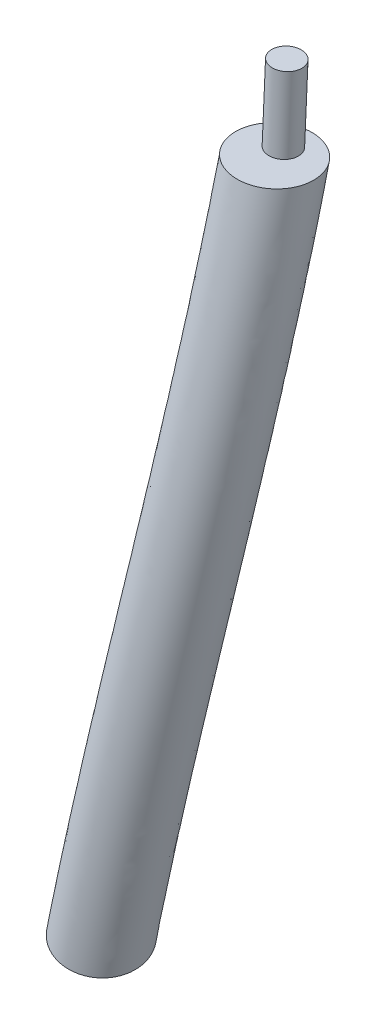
ISO-10303-21;
HEADER;
FILE_DESCRIPTION(('STEP AP214'),'2;1');
FILE_NAME('part.step','',(''),(''),'','','');
FILE_SCHEMA(('AUTOMOTIVE_DESIGN { 1 0 10303 214 1 1 1 1 }'));
ENDSEC;
DATA;
#1=APPLICATION_CONTEXT('core data for automotive mechanical design processes');
#2=APPLICATION_PROTOCOL_DEFINITION('international standard','automotive_design',2000,#1);
#3=PRODUCT_CONTEXT('',#1,'mechanical');
#4=PRODUCT('Part','Part','',(#3));
#5=PRODUCT_RELATED_PRODUCT_CATEGORY('part','',(#4));
#6=PRODUCT_DEFINITION_FORMATION('','',#4);
#7=PRODUCT_DEFINITION_CONTEXT('part definition',#1,'design');
#8=PRODUCT_DEFINITION('design','',#6,#7);
#9=PRODUCT_DEFINITION_SHAPE('','',#8);
#10=(LENGTH_UNIT() NAMED_UNIT(*) SI_UNIT(.MILLI.,.METRE.));
#11=(NAMED_UNIT(*) PLANE_ANGLE_UNIT() SI_UNIT($,.RADIAN.));
#12=(NAMED_UNIT(*) SI_UNIT($,.STERADIAN.) SOLID_ANGLE_UNIT());
#13=UNCERTAINTY_MEASURE_WITH_UNIT(LENGTH_MEASURE(1.E-05),#10,'distance_accuracy_value','');
#14=(GEOMETRIC_REPRESENTATION_CONTEXT(3) GLOBAL_UNCERTAINTY_ASSIGNED_CONTEXT((#13)) GLOBAL_UNIT_ASSIGNED_CONTEXT((#10,
#11,#12)) REPRESENTATION_CONTEXT('',''));
#15=CARTESIAN_POINT('',(0.,0.,0.));
#16=DIRECTION('',(0.,0.,1.));
#17=DIRECTION('',(1.,0.,0.));
#18=AXIS2_PLACEMENT_3D('',#15,#16,#17);
#19=CARTESIAN_POINT('',(-46.8725463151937,-4.55928526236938,-31.8));
#20=DIRECTION('',(-0.0440198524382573,-0.999030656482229,0.));
#21=DIRECTION('',(0.999030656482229,-0.0440198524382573,0.));
#22=AXIS2_PLACEMENT_3D('',#19,#20,#21);
#23=PLANE('',#22);
#24=CARTESIAN_POINT('',(-45.9172421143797,-4.60137841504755,-31.8));
#25=DIRECTION('',(0.0440198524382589,0.999030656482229,0.));
#26=DIRECTION('',(-0.999030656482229,0.0440198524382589,0.));
#27=AXIS2_PLACEMENT_3D('',#24,#25,#26);
#28=CIRCLE('',#27,0.193254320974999);
#29=CARTESIAN_POINT('',(-46.1103091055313,-4.59287138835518,-31.8));
#30=VERTEX_POINT('',#29);
#31=EDGE_CURVE('E18',#30,#30,#28,.F.);
#32=ORIENTED_EDGE('',*,*,#31,.F.);
#33=EDGE_LOOP('',(#32));
#34=FACE_BOUND('',#33,.T.);
#35=ADVANCED_FACE('F15',(#34),#23,.F.);
#36=CARTESIAN_POINT('',(-45.9392520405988,-5.10089374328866,-31.8));
#37=DIRECTION('',(0.0440198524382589,0.999030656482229,0.));
#38=DIRECTION('',(-0.999030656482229,0.0440198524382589,0.));
#39=AXIS2_PLACEMENT_3D('',#36,#37,#38);
#40=CYLINDRICAL_SURFACE('',#39,0.193254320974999);
#41=ORIENTED_EDGE('',*,*,#31,.T.);
#42=EDGE_LOOP('',(#41));
#43=FACE_BOUND('',#42,.T.);
#44=CARTESIAN_POINT('',(-45.9612619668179,-5.60040907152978,-31.8));
#45=DIRECTION('',(0.0440198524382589,0.999030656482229,0.));
#46=DIRECTION('',(-0.999030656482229,0.0440198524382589,0.));
#47=AXIS2_PLACEMENT_3D('',#44,#45,#46);
#48=CIRCLE('',#47,0.193254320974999);
#49=CARTESIAN_POINT('',(-46.1543289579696,-5.59190204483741,-31.8));
#50=VERTEX_POINT('',#49);
#51=EDGE_CURVE('E27',#50,#50,#48,.F.);
#52=ORIENTED_EDGE('',*,*,#51,.F.);
#53=EDGE_LOOP('',(#52));
#54=FACE_BOUND('',#53,.T.);
#55=ADVANCED_FACE('F52',(#43,#54),#40,.T.);
#56=CARTESIAN_POINT('',(-46.916566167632,-5.55831591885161,-31.8));
#57=DIRECTION('',(0.0440198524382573,0.999030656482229,0.));
#58=DIRECTION('',(-0.999030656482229,0.0440198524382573,0.));
#59=AXIS2_PLACEMENT_3D('',#56,#57,#58);
#60=PLANE('',#59);
#61=ORIENTED_EDGE('',*,*,#51,.T.);
#62=EDGE_LOOP('',(#61));
#63=FACE_BOUND('',#62,.T.);
#64=CARTESIAN_POINT('',(-45.4176626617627,-5.62436145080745,-31.6436344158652));
#65=CARTESIAN_POINT('',(-45.41756531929,-5.6243657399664,-31.671612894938));
#66=CARTESIAN_POINT('',(-45.4198199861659,-5.62426639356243,-31.6996243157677));
#67=CARTESIAN_POINT('',(-45.4289979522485,-5.62386198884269,-31.7549182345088));
#68=CARTESIAN_POINT('',(-45.4359310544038,-5.62355649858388,-31.7821990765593));
#69=CARTESIAN_POINT('',(-45.4542737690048,-5.62274827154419,-31.8351825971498));
#70=CARTESIAN_POINT('',(-45.4656790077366,-5.62224572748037,-31.8608867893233));
#71=CARTESIAN_POINT('',(-45.4926475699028,-5.62105742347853,-31.9100091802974));
#72=CARTESIAN_POINT('',(-45.5082111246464,-5.62037165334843,-31.9334272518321));
#73=CARTESIAN_POINT('',(-45.5430204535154,-5.61883786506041,-31.9772657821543));
#74=CARTESIAN_POINT('',(-45.5622591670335,-5.61799015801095,-31.9976918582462));
#75=CARTESIAN_POINT('',(-45.603892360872,-5.61615569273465,-32.0350207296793));
#76=CARTESIAN_POINT('',(-45.6262870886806,-5.61516892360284,-32.0519232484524));
#77=CARTESIAN_POINT('',(-45.6735670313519,-5.61308564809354,-32.0817096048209));
#78=CARTESIAN_POINT('',(-45.6984495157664,-5.6119892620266,-32.0945977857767));
#79=CARTESIAN_POINT('',(-45.7500521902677,-5.60971551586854,-32.1160352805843));
#80=CARTESIAN_POINT('',(-45.7767747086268,-5.60853805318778,-32.1245789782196));
#81=CARTESIAN_POINT('',(-45.8313060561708,-5.60613526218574,-32.137076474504));
#82=CARTESIAN_POINT('',(-45.8591162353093,-5.60490987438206,-32.1410243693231));
#83=CARTESIAN_POINT('',(-45.915004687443,-5.60244728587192,-32.144207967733));
#84=CARTESIAN_POINT('',(-45.9430829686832,-5.60121008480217,-32.1434435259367));
#85=CARTESIAN_POINT('',(-45.9988317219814,-5.59875365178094,-32.1372196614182));
#86=CARTESIAN_POINT('',(-46.0265000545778,-5.59753451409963,-32.1317410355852));
#87=CARTESIAN_POINT('',(-46.0804957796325,-5.59515532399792,-32.1162356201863));
#88=CARTESIAN_POINT('',(-46.1068248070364,-5.59399519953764,-32.1062145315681));
#89=CARTESIAN_POINT('',(-46.157547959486,-5.59176020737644,-32.0818619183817));
#90=CARTESIAN_POINT('',(-46.1819335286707,-5.5906857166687,-32.0675125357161));
#91=CARTESIAN_POINT('',(-46.2279564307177,-5.58865782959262,-32.0349285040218));
#92=CARTESIAN_POINT('',(-46.2495939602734,-5.58770442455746,-32.016694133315));
#93=CARTESIAN_POINT('',(-46.2895534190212,-5.58594370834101,-31.9768136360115));
#94=CARTESIAN_POINT('',(-46.3078683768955,-5.58513670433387,-31.9551605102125));
#95=CARTESIAN_POINT('',(-46.340603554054,-5.58369430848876,-31.9090834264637));
#96=CARTESIAN_POINT('',(-46.3550240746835,-5.58305890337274,-31.8846596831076));
#97=CARTESIAN_POINT('',(-46.3795658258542,-5.58197753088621,-31.8337188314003));
#98=CARTESIAN_POINT('',(-46.3896841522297,-5.58153169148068,-31.8072003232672));
#99=CARTESIAN_POINT('',(-46.4052932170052,-5.58084391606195,-31.7528804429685));
#100=CARTESIAN_POINT('',(-46.4107938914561,-5.58060154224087,-31.725081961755));
#101=CARTESIAN_POINT('',(-46.4158983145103,-5.58037662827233,-31.679266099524));
#102=CARTESIAN_POINT('',(-46.4169234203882,-5.58033145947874,-31.6613922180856));
#103=CARTESIAN_POINT('',(-46.4170867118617,-5.58032426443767,-31.6155303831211));
#104=CARTESIAN_POINT('',(-46.4148348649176,-5.58042348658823,-31.5875228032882));
#105=CARTESIAN_POINT('',(-46.4056631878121,-5.58082761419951,-31.5322360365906));
#106=CARTESIAN_POINT('',(-46.3987335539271,-5.58113295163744,-31.5049585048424));
#107=CARTESIAN_POINT('',(-46.3803981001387,-5.58194085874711,-31.4519809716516));
#108=CARTESIAN_POINT('',(-46.3689966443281,-5.58244323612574,-31.4262794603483));
#109=CARTESIAN_POINT('',(-46.3420358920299,-5.58363119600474,-31.3771618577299));
#110=CARTESIAN_POINT('',(-46.3264763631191,-5.58431678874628,-31.3537458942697));
#111=CARTESIAN_POINT('',(-46.2916759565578,-5.58585018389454,-31.3099115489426));
#112=CARTESIAN_POINT('',(-46.2724422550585,-5.58669767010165,-31.2894874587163));
#113=CARTESIAN_POINT('',(-46.2308196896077,-5.58853166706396,-31.2521612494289));
#114=CARTESIAN_POINT('',(-46.2084305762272,-5.58951818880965,-31.2352594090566));
#115=CARTESIAN_POINT('',(-46.1611596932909,-5.59160106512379,-31.2054709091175));
#116=CARTESIAN_POINT('',(-46.1362803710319,-5.59269731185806,-31.1925803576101));
#117=CARTESIAN_POINT('',(-46.0846838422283,-5.59497078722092,-31.1711368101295));
#118=CARTESIAN_POINT('',(-46.0579643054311,-5.59614811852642,-31.1625894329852));
#119=CARTESIAN_POINT('',(-46.0034338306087,-5.5985508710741,-31.1500819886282));
#120=CARTESIAN_POINT('',(-45.9756213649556,-5.59977635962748,-31.1461285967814));
#121=CARTESIAN_POINT('',(-45.919727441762,-5.60223918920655,-31.1429341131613));
#122=CARTESIAN_POINT('',(-45.8916459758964,-5.60347653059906,-31.1436931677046));
#123=CARTESIAN_POINT('',(-45.8358880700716,-5.60593336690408,-31.1499068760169));
#124=CARTESIAN_POINT('',(-45.8082138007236,-5.60715276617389,-31.1553810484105));
#125=CARTESIAN_POINT('',(-45.7542057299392,-5.6095325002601,-31.1708790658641));
#126=CARTESIAN_POINT('',(-45.7278702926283,-5.61069290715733,-31.1808972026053));
#127=CARTESIAN_POINT('',(-45.6771367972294,-5.6129283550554,-31.2052446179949));
#128=CARTESIAN_POINT('',(-45.6527470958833,-5.61400302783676,-31.2195913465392));
#129=CARTESIAN_POINT('',(-45.6067161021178,-5.61603127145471,-31.252171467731));
#130=CARTESIAN_POINT('',(-45.585074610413,-5.61698485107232,-31.2704045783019));
#131=CARTESIAN_POINT('',(-45.5451113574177,-5.61874573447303,-31.3102805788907));
#132=CARTESIAN_POINT('',(-45.5267959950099,-5.61955275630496,-31.331929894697));
#133=CARTESIAN_POINT('',(-45.4940597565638,-5.62099519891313,-31.3779997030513));
#134=CARTESIAN_POINT('',(-45.4796385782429,-5.62163063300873,-31.4024199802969));
#135=CARTESIAN_POINT('',(-45.4550962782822,-5.62271202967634,-31.4533520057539));
#136=CARTESIAN_POINT('',(-45.4449776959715,-5.62315788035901,-31.4798649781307));
#137=CARTESIAN_POINT('',(-45.4293667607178,-5.62384573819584,-31.5341738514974));
#138=CARTESIAN_POINT('',(-45.4238644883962,-5.62408818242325,-31.561966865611));
#139=CARTESIAN_POINT('',(-45.4187521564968,-5.62431344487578,-31.6078090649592));
#140=CARTESIAN_POINT('',(-45.4177250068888,-5.62435870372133,-31.6257149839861));
#141=CARTESIAN_POINT('',(-45.4176626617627,-5.62436145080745,-31.6436344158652));
#142=B_SPLINE_CURVE_WITH_KNOTS('',3,(#64,#65,#66,#67,#68,#69,#70,#71,#72,#73,#74,#75,#76,#77,
#78,#79,#80,#81,#82,#83,#84,#85,#86,#87,#88,#89,#90,#91,#92,#93,#94,#95,#96,#97,#98,#99,#100,
#101,#102,#103,#104,#105,#106,#107,#108,#109,#110,#111,#112,#113,#114,#115,#116,#117,#118,#119,
#120,#121,#122,#123,#124,#125,#126,#127,#128,#129,#130,#131,#132,#133,#134,#135,#136,#137,#138,
#139,#140,#141),.UNSPECIFIED.,.T.,.F.,(4,2,2,2,2,2,2,2,2,2,2,2,2,2,2,2,2,2,2,2,2,2,2,2,2,2,2,2,
2,2,2,2,2,2,2,2,2,2,4),(0.,0.0838797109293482,0.167935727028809,0.251909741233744,
0.335888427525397,0.419707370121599,0.503532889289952,0.587267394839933,0.671109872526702,
0.755059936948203,0.839012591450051,0.92330885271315,1.00749961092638,1.09204259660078,
1.17657952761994,1.26129183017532,1.3459975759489,1.43076041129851,1.51534038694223,
1.56896722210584,1.65283478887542,1.73687867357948,1.820840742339,1.90480750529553,
1.98861191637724,2.07242295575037,2.156152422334,2.23998993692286,2.32394912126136,
2.40791091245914,2.49222195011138,2.57642736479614,2.66097687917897,2.7455202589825,
2.83022460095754,2.91492236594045,2.99967004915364,3.08423515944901,3.13795776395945),.UNSPECIFIED.);
#143=CARTESIAN_POINT('',(-45.4176626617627,-5.62436145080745,-31.6436344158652));
#144=VERTEX_POINT('',#143);
#145=EDGE_CURVE('E22',#144,#144,#142,.T.);
#146=ORIENTED_EDGE('',*,*,#145,.T.);
#147=EDGE_LOOP('',(#146));
#148=FACE_BOUND('',#147,.T.);
#149=ADVANCED_FACE('F46',(#63,#148),#60,.T.);
#150=CARTESIAN_POINT('',(-48.2927702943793,-14.3510934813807,-30.812186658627));
#151=DIRECTION('',(-0.194254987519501,-0.968601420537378,-0.155165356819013));
#152=DIRECTION('',(0.980476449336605,-0.196636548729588,0.));
#153=AXIS2_PLACEMENT_3D('',#150,#151,#152);
#154=PLANE('',#153);
#155=CARTESIAN_POINT('',(-46.8104671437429,-14.6513251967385,-30.79375415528));
#156=CARTESIAN_POINT('',(-46.8116652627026,-14.655526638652,-30.766027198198));
#157=CARTESIAN_POINT('',(-46.815184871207,-14.6592619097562,-30.7383039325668));
#158=CARTESIAN_POINT('',(-46.8267871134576,-14.6656895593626,-30.683654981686));
#159=CARTESIAN_POINT('',(-46.8348795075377,-14.6683796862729,-30.6567311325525));
#160=CARTESIAN_POINT('',(-46.8553908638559,-14.6726298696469,-30.6045212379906));
#161=CARTESIAN_POINT('',(-46.8678050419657,-14.6741911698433,-30.5792334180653));
#162=CARTESIAN_POINT('',(-46.8966108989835,-14.6761434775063,-30.5309836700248));
#163=CARTESIAN_POINT('',(-46.9130028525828,-14.6765344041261,-30.5080219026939));
#164=CARTESIAN_POINT('',(-46.9492968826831,-14.6761348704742,-30.4650786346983));
#165=CARTESIAN_POINT('',(-46.9691986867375,-14.6753445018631,-30.4450969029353));
#166=CARTESIAN_POINT('',(-47.0119503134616,-14.6726047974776,-30.4086774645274));
#167=CARTESIAN_POINT('',(-47.0348003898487,-14.670655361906,-30.3922400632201));
#168=CARTESIAN_POINT('',(-47.0827819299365,-14.665654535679,-30.3633879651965));
#169=CARTESIAN_POINT('',(-47.1079118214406,-14.6626039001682,-30.3509705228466));
#170=CARTESIAN_POINT('',(-47.1597873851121,-14.6554823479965,-30.3304817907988));
#171=CARTESIAN_POINT('',(-47.1865350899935,-14.6514101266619,-30.3224161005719));
#172=CARTESIAN_POINT('',(-47.2408391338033,-14.6423660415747,-30.3108882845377));
#173=CARTESIAN_POINT('',(-47.2683949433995,-14.637394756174,-30.3074232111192));
#174=CARTESIAN_POINT('',(-47.3235494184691,-14.6266919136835,-30.3051853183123));
#175=CARTESIAN_POINT('',(-47.3511480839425,-14.6209603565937,-30.3064124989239));
#176=CARTESIAN_POINT('',(-47.4056223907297,-14.6088957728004,-30.3135266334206));
#177=CARTESIAN_POINT('',(-47.4324975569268,-14.6025623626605,-30.3194165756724));
#178=CARTESIAN_POINT('',(-47.4847088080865,-14.5894856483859,-30.3356819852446));
#179=CARTESIAN_POINT('',(-47.5100468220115,-14.5827428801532,-30.3460516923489));
#180=CARTESIAN_POINT('',(-47.5585196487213,-14.5690265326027,-30.3709901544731));
#181=CARTESIAN_POINT('',(-47.5816529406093,-14.5620527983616,-30.3855617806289));
#182=CARTESIAN_POINT('',(-47.6250379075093,-14.5480775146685,-30.4184862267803));
#183=CARTESIAN_POINT('',(-47.6452898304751,-14.5410759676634,-30.4368387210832));
#184=CARTESIAN_POINT('',(-47.6823411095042,-14.5272426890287,-30.4768060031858));
#185=CARTESIAN_POINT('',(-47.6991401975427,-14.5204109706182,-30.4984210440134));
#186=CARTESIAN_POINT('',(-47.7288057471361,-14.5071121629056,-30.544298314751));
#187=CARTESIAN_POINT('',(-47.7416724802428,-14.5006450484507,-30.5685603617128));
#188=CARTESIAN_POINT('',(-47.7631219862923,-14.4882522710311,-30.6190676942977));
#189=CARTESIAN_POINT('',(-47.7717000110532,-14.4823272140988,-30.6453151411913));
#190=CARTESIAN_POINT('',(-47.7842915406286,-14.4712047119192,-30.698982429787));
#191=CARTESIAN_POINT('',(-47.7883147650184,-14.4660057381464,-30.7263996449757));
#192=CARTESIAN_POINT('',(-47.7910833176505,-14.4582624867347,-30.7712699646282));
#193=CARTESIAN_POINT('',(-47.7912416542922,-14.4554535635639,-30.7886061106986));
#194=CARTESIAN_POINT('',(-47.7892944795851,-14.4486254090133,-30.8336677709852));
#195=CARTESIAN_POINT('',(-47.7857748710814,-14.4448901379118,-30.8613910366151));
#196=CARTESIAN_POINT('',(-47.774172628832,-14.4384624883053,-30.9160399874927));
#197=CARTESIAN_POINT('',(-47.7660802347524,-14.4357723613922,-30.9429638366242));
#198=CARTESIAN_POINT('',(-47.7455688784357,-14.4315221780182,-30.9951737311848));
#199=CARTESIAN_POINT('',(-47.7331547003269,-14.4299608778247,-31.0204615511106));
#200=CARTESIAN_POINT('',(-47.7043488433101,-14.4280085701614,-31.0687112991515));
#201=CARTESIAN_POINT('',(-47.6879568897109,-14.4276176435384,-31.0916730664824));
#202=CARTESIAN_POINT('',(-47.6516628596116,-14.42801717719,-31.1346163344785));
#203=CARTESIAN_POINT('',(-47.6317610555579,-14.428807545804,-31.1545980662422));
#204=CARTESIAN_POINT('',(-47.5890094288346,-14.4315472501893,-31.191017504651));
#205=CARTESIAN_POINT('',(-47.5661593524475,-14.4334966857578,-31.2074549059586));
#206=CARTESIAN_POINT('',(-47.5181778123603,-14.4384975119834,-31.236307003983));
#207=CARTESIAN_POINT('',(-47.4930479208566,-14.4415481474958,-31.2487244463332));
#208=CARTESIAN_POINT('',(-47.4411723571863,-14.4486696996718,-31.2692131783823));
#209=CARTESIAN_POINT('',(-47.4144246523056,-14.4527419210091,-31.2772788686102));
#210=CARTESIAN_POINT('',(-47.3601206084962,-14.4617860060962,-31.2888066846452));
#211=CARTESIAN_POINT('',(-47.3325647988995,-14.4667572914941,-31.2922717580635));
#212=CARTESIAN_POINT('',(-47.277410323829,-14.4774601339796,-31.2945096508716));
#213=CARTESIAN_POINT('',(-47.2498116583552,-14.4831916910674,-31.2932824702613));
#214=CARTESIAN_POINT('',(-47.1953373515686,-14.4952562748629,-31.2861683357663));
#215=CARTESIAN_POINT('',(-47.1684621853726,-14.5015896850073,-31.2802783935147));
#216=CARTESIAN_POINT('',(-47.1162509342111,-14.5146663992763,-31.2640129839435));
#217=CARTESIAN_POINT('',(-47.0909129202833,-14.5214091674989,-31.2536432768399));
#218=CARTESIAN_POINT('',(-47.0424400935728,-14.5351255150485,-31.2287048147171));
#219=CARTESIAN_POINT('',(-47.019306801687,-14.5420992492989,-31.2141331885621));
#220=CARTESIAN_POINT('',(-46.9759218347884,-14.5560745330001,-31.1812087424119));
#221=CARTESIAN_POINT('',(-46.9556699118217,-14.5630760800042,-31.1628562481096));
#222=CARTESIAN_POINT('',(-46.9186186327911,-14.5769093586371,-31.1228889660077));
#223=CARTESIAN_POINT('',(-46.9018195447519,-14.583741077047,-31.1012739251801));
#224=CARTESIAN_POINT('',(-46.8721539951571,-14.597039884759,-31.0553966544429));
#225=CARTESIAN_POINT('',(-46.8592872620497,-14.603506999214,-31.0311346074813));
#226=CARTESIAN_POINT('',(-46.8378377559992,-14.6158997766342,-30.980627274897));
#227=CARTESIAN_POINT('',(-46.829259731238,-14.6218248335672,-30.9543798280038));
#228=CARTESIAN_POINT('',(-46.8166682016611,-14.6329473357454,-30.9007125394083));
#229=CARTESIAN_POINT('',(-46.8126449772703,-14.6381463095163,-30.8732953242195));
#230=CARTESIAN_POINT('',(-46.8098764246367,-14.6458895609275,-30.8284250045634));
#231=CARTESIAN_POINT('',(-46.8097180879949,-14.6486984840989,-30.8110888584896));
#232=CARTESIAN_POINT('',(-46.8104671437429,-14.6513251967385,-30.79375415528));
#233=B_SPLINE_CURVE_WITH_KNOTS('',3,(#155,#156,#157,#158,#159,#160,#161,#162,#163,#164,#165,
#166,#167,#168,#169,#170,#171,#172,#173,#174,#175,#176,#177,#178,#179,#180,#181,#182,#183,#184,
#185,#186,#187,#188,#189,#190,#191,#192,#193,#194,#195,#196,#197,#198,#199,#200,#201,#202,#203,
#204,#205,#206,#207,#208,#209,#210,#211,#212,#213,#214,#215,#216,#217,#218,#219,#220,#221,#222,
#223,#224,#225,#226,#227,#228,#229,#230,#231,#232),.UNSPECIFIED.,.T.,.F.,(4,2,2,2,2,2,2,2,2,2,2,
2,2,2,2,2,2,2,2,2,2,2,2,2,2,2,2,2,2,2,2,2,2,2,2,2,2,2,4),(0.,0.0841521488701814,
0.168484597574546,0.252723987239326,0.336969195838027,0.421207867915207,0.505453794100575,
0.589642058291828,0.673938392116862,0.758180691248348,0.842422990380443,0.926719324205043,
1.01090758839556,1.09515351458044,1.17939218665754,1.26363739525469,1.34787678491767,
1.43220923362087,1.51636138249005,1.56897272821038,1.6531248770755,1.73745732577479,
1.82169671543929,1.90594192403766,1.99018059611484,2.0744265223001,2.15861478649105,
2.24291112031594,2.32715341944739,2.41139571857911,2.49569205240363,2.57988031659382,
2.66412624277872,2.74836491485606,2.83261012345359,2.91684951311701,3.0011819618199,
3.08533411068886,3.13794545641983),.UNSPECIFIED.);
#234=CARTESIAN_POINT('',(-46.8104671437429,-14.6513251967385,-30.79375415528));
#235=VERTEX_POINT('',#234);
#236=EDGE_CURVE('E10',#235,#235,#233,.T.);
#237=ORIENTED_EDGE('',*,*,#236,.T.);
#238=EDGE_LOOP('',(#237));
#239=FACE_BOUND('',#238,.T.);
#240=ADVANCED_FACE('F43',(#239),#154,.T.);
#241=CARTESIAN_POINT('',(-45.3614975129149,-4.62586594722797,-31.8));
#242=CARTESIAN_POINT('',(-45.3614975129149,-4.62586594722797,-29.8));
#243=CARTESIAN_POINT('',(-47.3595588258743,-4.53782624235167,-30.8));
#244=CARTESIAN_POINT('',(-47.3595588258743,-4.53782624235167,-32.8));
#245=CARTESIAN_POINT('',(-45.3614975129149,-4.62586594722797,-33.8));
#246=CARTESIAN_POINT('',(-45.3614975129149,-4.62586594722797,-31.8));
#247=CARTESIAN_POINT('',(-45.4509363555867,-6.65568069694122,-31.480848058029));
#248=CARTESIAN_POINT('',(-45.4661045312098,-6.65501234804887,-29.48084805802));
#249=CARTESIAN_POINT('',(-47.4523269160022,-6.47074320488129,-30.49603095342));
#250=CARTESIAN_POINT('',(-47.4371587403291,-6.47141155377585,-32.496030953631));
#251=CARTESIAN_POINT('',(-45.435768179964,-6.65634904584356,-33.48084805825));
#252=CARTESIAN_POINT('',(-45.4509363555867,-6.65568069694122,-31.480848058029));
#253=CARTESIAN_POINT('',(-45.6660287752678,-8.68007791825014,-31.162453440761));
#254=CARTESIAN_POINT('',(-45.6950492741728,-8.7160084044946,-29.1625976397));
#255=CARTESIAN_POINT('',(-47.664092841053,-8.4166757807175,-30.18993612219));
#256=CARTESIAN_POINT('',(-47.635072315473,-8.38074529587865,-32.18979185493));
#257=CARTESIAN_POINT('',(-45.6370082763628,-8.6441474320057,-33.16230930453));
#258=CARTESIAN_POINT('',(-45.6660287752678,-8.68007791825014,-31.162453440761));
#259=CARTESIAN_POINT('',(-46.0049524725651,-10.6742942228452,-30.916287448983));
#260=CARTESIAN_POINT('',(-46.0489695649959,-10.7850981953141,-28.91631308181));
#261=CARTESIAN_POINT('',(-47.9949502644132,-10.3720757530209,-29.94356935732));
#262=CARTESIAN_POINT('',(-47.9509332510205,-10.2612715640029,-31.943543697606));
#263=CARTESIAN_POINT('',(-45.9609353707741,-10.5634900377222,-32.91626189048));
#264=CARTESIAN_POINT('',(-46.0049524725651,-10.6742942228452,-30.916287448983));
#265=CARTESIAN_POINT('',(-46.4086665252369,-12.6675564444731,-30.79375415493));
#266=CARTESIAN_POINT('',(-46.4747627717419,-12.8725945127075,-28.80300345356));
#267=CARTESIAN_POINT('',(-48.4020013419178,-12.3742428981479,-29.82275212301));
#268=CARTESIAN_POINT('',(-48.3359050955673,-12.1692048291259,-31.8135028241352));
#269=CARTESIAN_POINT('',(-46.3425702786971,-12.4625183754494,-32.784504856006));
#270=CARTESIAN_POINT('',(-46.4086665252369,-12.6675564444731,-30.79375415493));
#271=CARTESIAN_POINT('',(-46.8104671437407,-14.6513251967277,-30.79375415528));
#272=CARTESIAN_POINT('',(-46.8956753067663,-14.9507225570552,-28.81812747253));
#273=CARTESIAN_POINT('',(-48.8131221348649,-14.4040271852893,-29.83031413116));
#274=CARTESIAN_POINT('',(-48.7279139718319,-14.1046298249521,-31.8059408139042));
#275=CARTESIAN_POINT('',(-46.7252589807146,-14.3519278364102,-32.769380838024));
#276=CARTESIAN_POINT('',(-46.8104671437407,-14.6513251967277,-30.79375415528));
#277=(BOUNDED_SURFACE() B_SPLINE_SURFACE(5,5,((#241,#242,#243,#244,#245,#246),(#247,#248,#249,
#250,#251,#252),(#253,#254,#255,#256,#257,#258),(#259,#260,#261,#262,#263,#264),(#265,#266,#267,
#268,#269,#270),(#271,#272,#273,#274,#275,#276)),.UNSPECIFIED.,.F.,.T.,
.F.) B_SPLINE_SURFACE_WITH_KNOTS((6,6),(6,6),(0.,10.1231631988),(0.,3.14159265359),
.UNSPECIFIED.) GEOMETRIC_REPRESENTATION_ITEM() RATIONAL_B_SPLINE_SURFACE(((1.,0.2,0.2,0.2,0.2,
1.),(1.,0.2,0.2,0.2,0.2,1.),(1.,0.2,0.2,0.2,0.2,1.),(1.,0.2,0.2,0.2,0.2,1.),(1.,0.2,0.2,0.2,0.2,
1.),(1.,0.2,0.2,0.2,0.2,1.))) REPRESENTATION_ITEM('') SURFACE());
#278=ORIENTED_EDGE('',*,*,#236,.F.);
#279=EDGE_LOOP('',(#278));
#280=FACE_BOUND('',#279,.T.);
#281=ORIENTED_EDGE('',*,*,#145,.F.);
#282=EDGE_LOOP('',(#281));
#283=FACE_BOUND('',#282,.T.);
#284=ADVANCED_FACE('F39',(#280,#283),#277,.F.);
#285=CLOSED_SHELL('',(#35,#55,#149,#240,#284));
#286=MANIFOLD_SOLID_BREP('B1',#285);
#287=ADVANCED_BREP_SHAPE_REPRESENTATION('',(#18,#286),#14);
#288=SHAPE_DEFINITION_REPRESENTATION(#9,#287);
ENDSEC;
END-ISO-10303-21;
